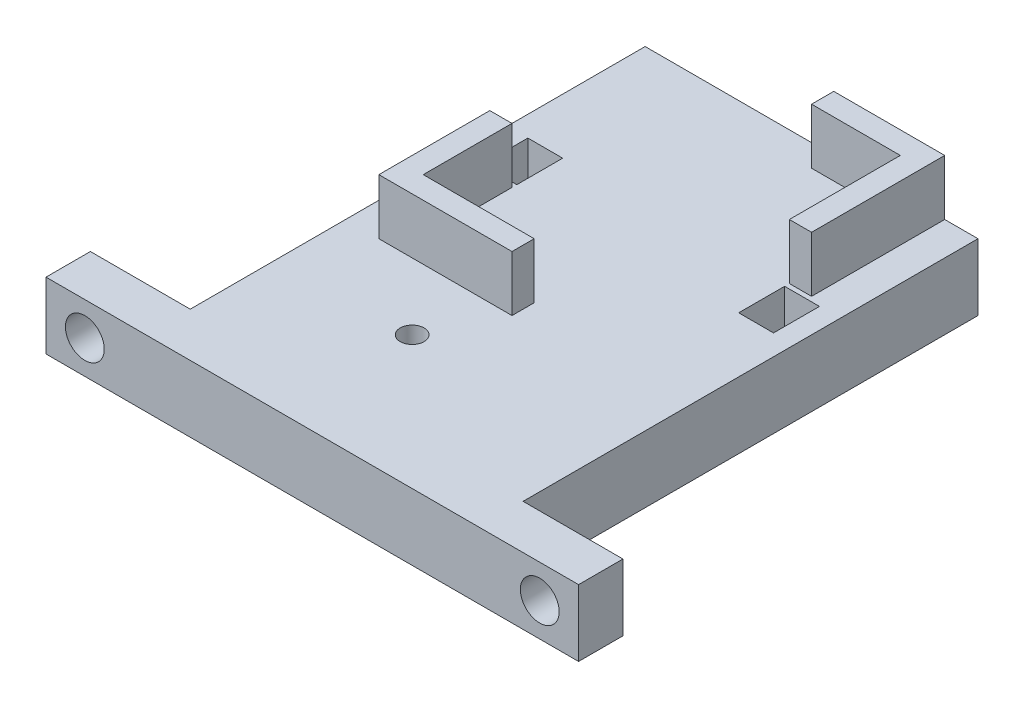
from build123d import *

# Parameters (mm, degrees)
SKIZZE1_W                       = 30
SKIZZE1_H                       = 45
AUFSATZ_LINEAR_AUSTRAGEN1_DEPTH = 6
SKIZZE2_W                       = 10
SKIZZE2_H                       = 2
SKIZZE2_W_2                     = 2
SKIZZE2_H_2                     = 10
AUFSATZ_LINEAR_AUSTRAGEN2_DEPTH = 5
SKIZZE3_W                       = 3.14
SKIZZE3_H                       = 4.14
SCHNITT_LINEAR_AUSTRAGEN1_DEPTH = 28.699277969
SKIZZE8_W                       = 9
SKIZZE8_H                       = 6
SKIZZE8_R                       = 1.75
AUFSATZ_LINEAR_AUSTRAGEN3_DEPTH = 4
SCHNITT_LINEAR_AUSTRAGEN2_DEPTH = 2.5
SKIZZE12_R                      = 1.075
SCHNITT_LINEAR_AUSTRAGEN4_DEPTH = 11


with BuildPart() as part:
    # Skizze1 → Aufsatz-Linear austragen1 (new body)
    with BuildSketch(Plane(origin=(0, 0, 0), x_dir=(1, 0, 0), z_dir=(0, 1, 0))):
        Rectangle(SKIZZE1_W, SKIZZE1_H)
    extrude(amount=AUFSATZ_LINEAR_AUSTRAGEN1_DEPTH)

    # Skizze2 → Aufsatz-Linear austragen2 (add)
    with BuildSketch(Plane(origin=(0, 6, 0), x_dir=(1, 0, 0), z_dir=(0, 1, 0))):
        Polygon((-10, 5.5), (-12, 5.5), (-12, -4.5), (-10, -4.5), (-10, -2.5), align=None)
        with Locations((-5, -3.5)):
            Rectangle(SKIZZE2_W, SKIZZE2_H)
        with Locations((11, 15.5)):
            Rectangle(SKIZZE2_W_2, SKIZZE2_H_2)
        Polygon((10, 20.5), (12, 20.5), (12, 22.5), (2, 22.5), (2, 20.5), align=None)
    extrude(amount=AUFSATZ_LINEAR_AUSTRAGEN2_DEPTH)

    # Skizze3 → Schnitt-Linear austragen1 (cut, through all)
    with BuildSketch(Plane(origin=(0, 6, 0), x_dir=(1, 0, 0), z_dir=(0, 1, 0))):
        with Locations((-11.57, 8)):
            Rectangle(SKIZZE3_W, SKIZZE3_H)
        with Locations((11.57, 8)):
            Rectangle(SKIZZE3_W, SKIZZE3_H)
    extrude(amount=-SCHNITT_LINEAR_AUSTRAGEN1_DEPTH, mode=Mode.SUBTRACT)

    # Skizze8 → Aufsatz-Linear austragen3 (add)
    # profile 1 of 2: a face of its own
    with BuildSketch(Plane.XY.offset(22.5)):
        with Locations((-19.5, 3)):
            Rectangle(SKIZZE8_W, SKIZZE8_H)
        with Locations((-20.5, 3)):
            Circle(SKIZZE8_R, mode=Mode.SUBTRACT)
    # profile 2 of 2: a face of its own
    with BuildSketch(Plane.XY.offset(22.5)):
        with Locations((19.5, 3)):
            Rectangle(SKIZZE8_W, SKIZZE8_H)
        with Locations(Location((20.5, 3, 0), (0, 0, 180))):
            Circle(SKIZZE8_R, mode=Mode.SUBTRACT)
    extrude(amount=-AUFSATZ_LINEAR_AUSTRAGEN3_DEPTH)

    # Skizze10 → Schnitt-Linear austragen2 (cut)
    with BuildSketch(Plane.XZ):
        Polygon((-3, 12.896003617), (-0.925, 11.698001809), (-0.925, 9.301998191), (-3, 8.103996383), (-5.075, 9.301998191), (-5.075, 11.698001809), align=None)
    extrude(amount=-SCHNITT_LINEAR_AUSTRAGEN2_DEPTH, mode=Mode.SUBTRACT)

    # Skizze12 → Schnitt-Linear austragen4 (cut)
    with BuildSketch(Plane.XZ.offset(-2.5)):
        with Locations(Location((-3, 10.5, 0), (0, 0, 270))):
            Circle(SKIZZE12_R)
    extrude(amount=-SCHNITT_LINEAR_AUSTRAGEN4_DEPTH, mode=Mode.SUBTRACT)


solid = part.part
